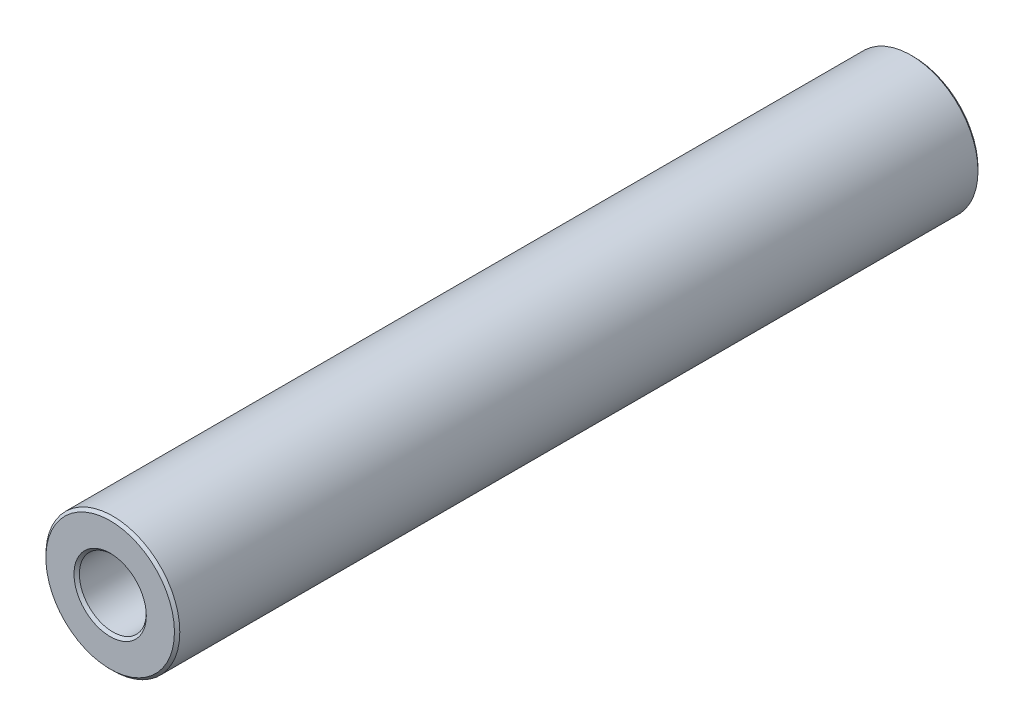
ISO-10303-21;
HEADER;
FILE_DESCRIPTION(('STEP AP214'),'2;1');
FILE_NAME('part.step','',(''),(''),'','','');
FILE_SCHEMA(('AUTOMOTIVE_DESIGN { 1 0 10303 214 1 1 1 1 }'));
ENDSEC;
DATA;
#1=APPLICATION_CONTEXT('core data for automotive mechanical design processes');
#2=APPLICATION_PROTOCOL_DEFINITION('international standard','automotive_design',2000,#1);
#3=PRODUCT_CONTEXT('',#1,'mechanical');
#4=PRODUCT('Part','Part','',(#3));
#5=PRODUCT_RELATED_PRODUCT_CATEGORY('part','',(#4));
#6=PRODUCT_DEFINITION_FORMATION('','',#4);
#7=PRODUCT_DEFINITION_CONTEXT('part definition',#1,'design');
#8=PRODUCT_DEFINITION('design','',#6,#7);
#9=PRODUCT_DEFINITION_SHAPE('','',#8);
#10=(LENGTH_UNIT() NAMED_UNIT(*) SI_UNIT(.MILLI.,.METRE.));
#11=(NAMED_UNIT(*) PLANE_ANGLE_UNIT() SI_UNIT($,.RADIAN.));
#12=(NAMED_UNIT(*) SI_UNIT($,.STERADIAN.) SOLID_ANGLE_UNIT());
#13=UNCERTAINTY_MEASURE_WITH_UNIT(LENGTH_MEASURE(1.E-05),#10,'distance_accuracy_value','');
#14=(GEOMETRIC_REPRESENTATION_CONTEXT(3) GLOBAL_UNCERTAINTY_ASSIGNED_CONTEXT((#13)) GLOBAL_UNIT_ASSIGNED_CONTEXT((#10,
#11,#12)) REPRESENTATION_CONTEXT('',''));
#15=CARTESIAN_POINT('',(0.,0.,0.));
#16=DIRECTION('',(0.,0.,1.));
#17=DIRECTION('',(1.,0.,0.));
#18=AXIS2_PLACEMENT_3D('',#15,#16,#17);
#19=CARTESIAN_POINT('',(0.,0.,15.));
#20=DIRECTION('',(0.,0.,1.));
#21=DIRECTION('',(1.,0.,0.));
#22=AXIS2_PLACEMENT_3D('',#19,#20,#21);
#23=PLANE('',#22);
#24=CARTESIAN_POINT('',(0.,0.,15.));
#25=DIRECTION('',(0.,0.,1.));
#26=DIRECTION('',(1.,0.,0.));
#27=AXIS2_PLACEMENT_3D('',#24,#25,#26);
#28=CIRCLE('',#27,1.35);
#29=CARTESIAN_POINT('',(1.35,0.,15.));
#30=VERTEX_POINT('',#29);
#31=EDGE_CURVE('E10',#30,#30,#28,.F.);
#32=ORIENTED_EDGE('',*,*,#31,.T.);
#33=EDGE_LOOP('',(#32));
#34=FACE_BOUND('',#33,.T.);
#35=CARTESIAN_POINT('',(0.,0.,15.));
#36=DIRECTION('',(0.,0.,1.));
#37=DIRECTION('',(1.,0.,0.));
#38=AXIS2_PLACEMENT_3D('',#35,#36,#37);
#39=CIRCLE('',#38,2.4);
#40=CARTESIAN_POINT('',(2.4,0.,15.));
#41=VERTEX_POINT('',#40);
#42=EDGE_CURVE('E45',#41,#41,#39,.T.);
#43=ORIENTED_EDGE('',*,*,#42,.T.);
#44=EDGE_LOOP('',(#43));
#45=FACE_BOUND('',#44,.T.);
#46=ADVANCED_FACE('F37',(#34,#45),#23,.T.);
#47=CARTESIAN_POINT('',(0.,0.,-15.));
#48=DIRECTION('',(0.,0.,1.));
#49=DIRECTION('',(1.,0.,0.));
#50=AXIS2_PLACEMENT_3D('',#47,#48,#49);
#51=PLANE('',#50);
#52=CARTESIAN_POINT('',(0.,0.,-15.));
#53=DIRECTION('',(0.,0.,1.));
#54=DIRECTION('',(1.,0.,0.));
#55=AXIS2_PLACEMENT_3D('',#52,#53,#54);
#56=CIRCLE('',#55,2.4);
#57=CARTESIAN_POINT('',(2.4,0.,-15.));
#58=VERTEX_POINT('',#57);
#59=EDGE_CURVE('E63',#58,#58,#56,.F.);
#60=ORIENTED_EDGE('',*,*,#59,.T.);
#61=EDGE_LOOP('',(#60));
#62=FACE_BOUND('',#61,.T.);
#63=CARTESIAN_POINT('',(0.,0.,-15.));
#64=DIRECTION('',(0.,0.,1.));
#65=DIRECTION('',(1.,0.,0.));
#66=AXIS2_PLACEMENT_3D('',#63,#64,#65);
#67=CIRCLE('',#66,1.35);
#68=CARTESIAN_POINT('',(1.35,0.,-15.));
#69=VERTEX_POINT('',#68);
#70=EDGE_CURVE('E67',#69,#69,#67,.T.);
#71=ORIENTED_EDGE('',*,*,#70,.T.);
#72=EDGE_LOOP('',(#71));
#73=FACE_BOUND('',#72,.T.);
#74=ADVANCED_FACE('F89',(#62,#73),#51,.F.);
#75=CARTESIAN_POINT('',(0.,0.,15.));
#76=DIRECTION('',(0.,0.,-1.));
#77=DIRECTION('',(-1.,0.,0.));
#78=AXIS2_PLACEMENT_3D('',#75,#76,#77);
#79=CYLINDRICAL_SURFACE('',#78,2.5);
#80=CARTESIAN_POINT('',(0.,0.,-14.9));
#81=DIRECTION('',(0.,0.,1.));
#82=DIRECTION('',(1.,0.,0.));
#83=AXIS2_PLACEMENT_3D('',#80,#81,#82);
#84=CIRCLE('',#83,2.5);
#85=CARTESIAN_POINT('',(2.5,0.,-14.9));
#86=VERTEX_POINT('',#85);
#87=EDGE_CURVE('E70',#86,#86,#84,.T.);
#88=ORIENTED_EDGE('',*,*,#87,.T.);
#89=EDGE_LOOP('',(#88));
#90=FACE_BOUND('',#89,.T.);
#91=CARTESIAN_POINT('',(0.,0.,14.9));
#92=DIRECTION('',(0.,0.,1.));
#93=DIRECTION('',(1.,0.,0.));
#94=AXIS2_PLACEMENT_3D('',#91,#92,#93);
#95=CIRCLE('',#94,2.5);
#96=CARTESIAN_POINT('',(2.5,0.,14.9));
#97=VERTEX_POINT('',#96);
#98=EDGE_CURVE('E73',#97,#97,#95,.F.);
#99=ORIENTED_EDGE('',*,*,#98,.T.);
#100=EDGE_LOOP('',(#99));
#101=FACE_BOUND('',#100,.T.);
#102=ADVANCED_FACE('F78',(#90,#101),#79,.T.);
#103=CARTESIAN_POINT('',(0.,0.,15.));
#104=DIRECTION('',(0.,0.,-1.));
#105=DIRECTION('',(-1.,0.,0.));
#106=AXIS2_PLACEMENT_3D('',#103,#104,#105);
#107=CYLINDRICAL_SURFACE('',#106,1.25);
#108=CARTESIAN_POINT('',(0.,0.,-14.9));
#109=DIRECTION('',(0.,0.,1.));
#110=DIRECTION('',(1.,0.,0.));
#111=AXIS2_PLACEMENT_3D('',#108,#109,#110);
#112=CIRCLE('',#111,1.25);
#113=CARTESIAN_POINT('',(1.25,0.,-14.9));
#114=VERTEX_POINT('',#113);
#115=EDGE_CURVE('E52',#114,#114,#112,.F.);
#116=ORIENTED_EDGE('',*,*,#115,.T.);
#117=EDGE_LOOP('',(#116));
#118=FACE_BOUND('',#117,.T.);
#119=CARTESIAN_POINT('',(0.,0.,14.9));
#120=DIRECTION('',(0.,0.,1.));
#121=DIRECTION('',(1.,0.,0.));
#122=AXIS2_PLACEMENT_3D('',#119,#120,#121);
#123=CIRCLE('',#122,1.25);
#124=CARTESIAN_POINT('',(1.25,0.,14.9));
#125=VERTEX_POINT('',#124);
#126=EDGE_CURVE('E57',#125,#125,#123,.T.);
#127=ORIENTED_EDGE('',*,*,#126,.T.);
#128=EDGE_LOOP('',(#127));
#129=FACE_BOUND('',#128,.T.);
#130=ADVANCED_FACE('F97',(#118,#129),#107,.F.);
#131=CARTESIAN_POINT('',(0.,0.,-14.9));
#132=DIRECTION('',(0.,0.,1.));
#133=DIRECTION('',(1.,0.,0.));
#134=AXIS2_PLACEMENT_3D('',#131,#132,#133);
#135=CONICAL_SURFACE('',#134,2.5,0.78539816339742);
#136=ORIENTED_EDGE('',*,*,#59,.F.);
#137=EDGE_LOOP('',(#136));
#138=FACE_BOUND('',#137,.T.);
#139=ORIENTED_EDGE('',*,*,#87,.F.);
#140=EDGE_LOOP('',(#139));
#141=FACE_BOUND('',#140,.T.);
#142=ADVANCED_FACE('F102',(#138,#141),#135,.T.);
#143=CARTESIAN_POINT('',(0.,0.,-15.));
#144=DIRECTION('',(0.,0.,-1.));
#145=DIRECTION('',(-1.,0.,0.));
#146=AXIS2_PLACEMENT_3D('',#143,#144,#145);
#147=CONICAL_SURFACE('',#146,1.35,0.785398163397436);
#148=ORIENTED_EDGE('',*,*,#115,.F.);
#149=EDGE_LOOP('',(#148));
#150=FACE_BOUND('',#149,.T.);
#151=ORIENTED_EDGE('',*,*,#70,.F.);
#152=EDGE_LOOP('',(#151));
#153=FACE_BOUND('',#152,.T.);
#154=ADVANCED_FACE('F86',(#150,#153),#147,.F.);
#155=CARTESIAN_POINT('',(0.,0.,14.9));
#156=DIRECTION('',(0.,0.,1.));
#157=DIRECTION('',(1.,0.,0.));
#158=AXIS2_PLACEMENT_3D('',#155,#156,#157);
#159=CONICAL_SURFACE('',#158,1.25,0.785398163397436);
#160=ORIENTED_EDGE('',*,*,#31,.F.);
#161=EDGE_LOOP('',(#160));
#162=FACE_BOUND('',#161,.T.);
#163=ORIENTED_EDGE('',*,*,#126,.F.);
#164=EDGE_LOOP('',(#163));
#165=FACE_BOUND('',#164,.T.);
#166=ADVANCED_FACE('F82',(#162,#165),#159,.F.);
#167=CARTESIAN_POINT('',(0.,0.,15.));
#168=DIRECTION('',(0.,0.,-1.));
#169=DIRECTION('',(-1.,0.,0.));
#170=AXIS2_PLACEMENT_3D('',#167,#168,#169);
#171=CONICAL_SURFACE('',#170,2.4,0.785398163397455);
#172=ORIENTED_EDGE('',*,*,#98,.F.);
#173=EDGE_LOOP('',(#172));
#174=FACE_BOUND('',#173,.T.);
#175=ORIENTED_EDGE('',*,*,#42,.F.);
#176=EDGE_LOOP('',(#175));
#177=FACE_BOUND('',#176,.T.);
#178=ADVANCED_FACE('F39',(#174,#177),#171,.T.);
#179=CLOSED_SHELL('',(#46,#74,#102,#130,#142,#154,#166,#178));
#180=MANIFOLD_SOLID_BREP('B2',#179);
#181=ADVANCED_BREP_SHAPE_REPRESENTATION('',(#18,#180),#14);
#182=SHAPE_DEFINITION_REPRESENTATION(#9,#181);
ENDSEC;
END-ISO-10303-21;
